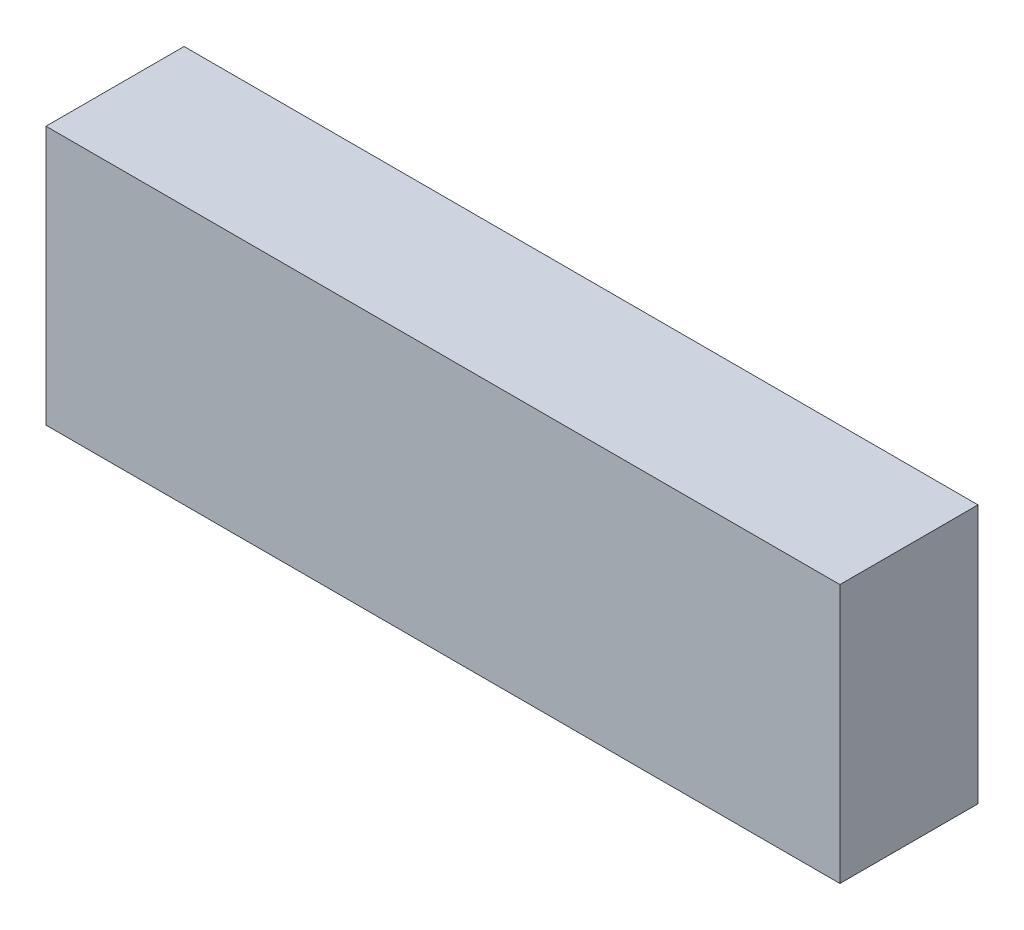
ISO-10303-21;
HEADER;
FILE_DESCRIPTION(('STEP AP214'),'2;1');
FILE_NAME('part.step','',(''),(''),'','','');
FILE_SCHEMA(('AUTOMOTIVE_DESIGN { 1 0 10303 214 1 1 1 1 }'));
ENDSEC;
DATA;
#1=APPLICATION_CONTEXT('core data for automotive mechanical design processes');
#2=APPLICATION_PROTOCOL_DEFINITION('international standard','automotive_design',2000,#1);
#3=PRODUCT_CONTEXT('',#1,'mechanical');
#4=PRODUCT('Part','Part','',(#3));
#5=PRODUCT_RELATED_PRODUCT_CATEGORY('part','',(#4));
#6=PRODUCT_DEFINITION_FORMATION('','',#4);
#7=PRODUCT_DEFINITION_CONTEXT('part definition',#1,'design');
#8=PRODUCT_DEFINITION('design','',#6,#7);
#9=PRODUCT_DEFINITION_SHAPE('','',#8);
#10=(LENGTH_UNIT() NAMED_UNIT(*) SI_UNIT(.MILLI.,.METRE.));
#11=(NAMED_UNIT(*) PLANE_ANGLE_UNIT() SI_UNIT($,.RADIAN.));
#12=(NAMED_UNIT(*) SI_UNIT($,.STERADIAN.) SOLID_ANGLE_UNIT());
#13=UNCERTAINTY_MEASURE_WITH_UNIT(LENGTH_MEASURE(1.E-05),#10,'distance_accuracy_value','');
#14=(GEOMETRIC_REPRESENTATION_CONTEXT(3) GLOBAL_UNCERTAINTY_ASSIGNED_CONTEXT((#13)) GLOBAL_UNIT_ASSIGNED_CONTEXT((#10,
#11,#12)) REPRESENTATION_CONTEXT('',''));
#15=CARTESIAN_POINT('',(0.,0.,0.));
#16=DIRECTION('',(0.,0.,1.));
#17=DIRECTION('',(1.,0.,0.));
#18=AXIS2_PLACEMENT_3D('',#15,#16,#17);
#19=CARTESIAN_POINT('',(115.,37.5,-20.));
#20=DIRECTION('',(-1.,0.,0.));
#21=DIRECTION('',(0.,0.,1.));
#22=AXIS2_PLACEMENT_3D('',#19,#20,#21);
#23=PLANE('',#22);
#24=DIRECTION('',(0.,0.,-1.));
#25=VECTOR('',#24,1.);
#26=CARTESIAN_POINT('',(115.,-37.5,-20.));
#27=LINE('',#26,#25);
#28=CARTESIAN_POINT('',(115.,-37.5,20.));
#29=VERTEX_POINT('',#28);
#30=CARTESIAN_POINT('',(115.,-37.5,-20.));
#31=VERTEX_POINT('',#30);
#32=EDGE_CURVE('E107',#29,#31,#27,.T.);
#33=ORIENTED_EDGE('',*,*,#32,.T.);
#34=DIRECTION('',(0.,-1.,0.));
#35=VECTOR('',#34,1.);
#36=CARTESIAN_POINT('',(115.,37.5,-20.));
#37=LINE('',#36,#35);
#38=CARTESIAN_POINT('',(115.,37.5,-20.));
#39=VERTEX_POINT('',#38);
#40=EDGE_CURVE('E11',#39,#31,#37,.T.);
#41=ORIENTED_EDGE('',*,*,#40,.F.);
#42=DIRECTION('',(0.,0.,-1.));
#43=VECTOR('',#42,1.);
#44=CARTESIAN_POINT('',(115.,37.5,-20.));
#45=LINE('',#44,#43);
#46=CARTESIAN_POINT('',(115.,37.5,20.));
#47=VERTEX_POINT('',#46);
#48=EDGE_CURVE('E91',#47,#39,#45,.T.);
#49=ORIENTED_EDGE('',*,*,#48,.F.);
#50=DIRECTION('',(0.,-1.,0.));
#51=VECTOR('',#50,1.);
#52=CARTESIAN_POINT('',(115.,37.5,20.));
#53=LINE('',#52,#51);
#54=EDGE_CURVE('E103',#47,#29,#53,.T.);
#55=ORIENTED_EDGE('',*,*,#54,.T.);
#56=EDGE_LOOP('',(#33,#41,#49,#55));
#57=FACE_BOUND('',#56,.T.);
#58=ADVANCED_FACE('F39',(#57),#23,.F.);
#59=CARTESIAN_POINT('',(-115.,37.5,-20.));
#60=DIRECTION('',(0.,0.,1.));
#61=DIRECTION('',(1.,0.,0.));
#62=AXIS2_PLACEMENT_3D('',#59,#60,#61);
#63=PLANE('',#62);
#64=DIRECTION('',(-1.,0.,0.));
#65=VECTOR('',#64,1.);
#66=CARTESIAN_POINT('',(-115.,-37.5,-20.));
#67=LINE('',#66,#65);
#68=CARTESIAN_POINT('',(-115.,-37.5,-20.));
#69=VERTEX_POINT('',#68);
#70=EDGE_CURVE('E96',#31,#69,#67,.T.);
#71=ORIENTED_EDGE('',*,*,#70,.T.);
#72=DIRECTION('',(0.,-1.,0.));
#73=VECTOR('',#72,1.);
#74=CARTESIAN_POINT('',(-115.,37.5,-20.));
#75=LINE('',#74,#73);
#76=CARTESIAN_POINT('',(-115.,37.5,-20.));
#77=VERTEX_POINT('',#76);
#78=EDGE_CURVE('E48',#77,#69,#75,.T.);
#79=ORIENTED_EDGE('',*,*,#78,.F.);
#80=DIRECTION('',(-1.,0.,0.));
#81=VECTOR('',#80,1.);
#82=CARTESIAN_POINT('',(-115.,37.5,-20.));
#83=LINE('',#82,#81);
#84=EDGE_CURVE('E86',#39,#77,#83,.T.);
#85=ORIENTED_EDGE('',*,*,#84,.F.);
#86=ORIENTED_EDGE('',*,*,#40,.T.);
#87=EDGE_LOOP('',(#71,#79,#85,#86));
#88=FACE_BOUND('',#87,.T.);
#89=ADVANCED_FACE('F95',(#88),#63,.F.);
#90=CARTESIAN_POINT('',(-115.,37.5,-20.));
#91=DIRECTION('',(1.,0.,0.));
#92=DIRECTION('',(0.,0.,-1.));
#93=AXIS2_PLACEMENT_3D('',#90,#91,#92);
#94=PLANE('',#93);
#95=DIRECTION('',(0.,0.,1.));
#96=VECTOR('',#95,1.);
#97=CARTESIAN_POINT('',(-115.,-37.5,-20.));
#98=LINE('',#97,#96);
#99=CARTESIAN_POINT('',(-115.,-37.5,20.));
#100=VERTEX_POINT('',#99);
#101=EDGE_CURVE('E73',#69,#100,#98,.T.);
#102=ORIENTED_EDGE('',*,*,#101,.T.);
#103=DIRECTION('',(0.,-1.,0.));
#104=VECTOR('',#103,1.);
#105=CARTESIAN_POINT('',(-115.,37.5,20.));
#106=LINE('',#105,#104);
#107=CARTESIAN_POINT('',(-115.,37.5,20.));
#108=VERTEX_POINT('',#107);
#109=EDGE_CURVE('E98',#108,#100,#106,.T.);
#110=ORIENTED_EDGE('',*,*,#109,.F.);
#111=DIRECTION('',(0.,0.,1.));
#112=VECTOR('',#111,1.);
#113=CARTESIAN_POINT('',(-115.,37.5,-20.));
#114=LINE('',#113,#112);
#115=EDGE_CURVE('E89',#77,#108,#114,.T.);
#116=ORIENTED_EDGE('',*,*,#115,.F.);
#117=ORIENTED_EDGE('',*,*,#78,.T.);
#118=EDGE_LOOP('',(#102,#110,#116,#117));
#119=FACE_BOUND('',#118,.T.);
#120=ADVANCED_FACE('F99',(#119),#94,.F.);
#121=CARTESIAN_POINT('',(-115.,37.5,20.));
#122=DIRECTION('',(0.,0.,-1.));
#123=DIRECTION('',(-1.,0.,0.));
#124=AXIS2_PLACEMENT_3D('',#121,#122,#123);
#125=PLANE('',#124);
#126=DIRECTION('',(1.,0.,0.));
#127=VECTOR('',#126,1.);
#128=CARTESIAN_POINT('',(-115.,-37.5,20.));
#129=LINE('',#128,#127);
#130=EDGE_CURVE('E79',#100,#29,#129,.T.);
#131=ORIENTED_EDGE('',*,*,#130,.T.);
#132=ORIENTED_EDGE('',*,*,#54,.F.);
#133=DIRECTION('',(1.,0.,0.));
#134=VECTOR('',#133,1.);
#135=CARTESIAN_POINT('',(-115.,37.5,20.));
#136=LINE('',#135,#134);
#137=EDGE_CURVE('E56',#108,#47,#136,.T.);
#138=ORIENTED_EDGE('',*,*,#137,.F.);
#139=ORIENTED_EDGE('',*,*,#109,.T.);
#140=EDGE_LOOP('',(#131,#132,#138,#139));
#141=FACE_BOUND('',#140,.T.);
#142=ADVANCED_FACE('F120',(#141),#125,.F.);
#143=CARTESIAN_POINT('',(0.,37.5,0.));
#144=DIRECTION('',(0.,1.,0.));
#145=DIRECTION('',(0.,0.,1.));
#146=AXIS2_PLACEMENT_3D('',#143,#144,#145);
#147=PLANE('',#146);
#148=ORIENTED_EDGE('',*,*,#48,.T.);
#149=ORIENTED_EDGE('',*,*,#84,.T.);
#150=ORIENTED_EDGE('',*,*,#115,.T.);
#151=ORIENTED_EDGE('',*,*,#137,.T.);
#152=EDGE_LOOP('',(#148,#149,#150,#151));
#153=FACE_BOUND('',#152,.T.);
#154=ADVANCED_FACE('F87',(#153),#147,.T.);
#155=CARTESIAN_POINT('',(0.,-37.5,0.));
#156=DIRECTION('',(0.,1.,0.));
#157=DIRECTION('',(0.,0.,1.));
#158=AXIS2_PLACEMENT_3D('',#155,#156,#157);
#159=PLANE('',#158);
#160=ORIENTED_EDGE('',*,*,#32,.F.);
#161=ORIENTED_EDGE('',*,*,#130,.F.);
#162=ORIENTED_EDGE('',*,*,#101,.F.);
#163=ORIENTED_EDGE('',*,*,#70,.F.);
#164=EDGE_LOOP('',(#160,#161,#162,#163));
#165=FACE_BOUND('',#164,.T.);
#166=ADVANCED_FACE('F123',(#165),#159,.F.);
#167=CLOSED_SHELL('',(#58,#89,#120,#142,#154,#166));
#168=MANIFOLD_SOLID_BREP('B2',#167);
#169=ADVANCED_BREP_SHAPE_REPRESENTATION('',(#18,#168),#14);
#170=SHAPE_DEFINITION_REPRESENTATION(#9,#169);
ENDSEC;
END-ISO-10303-21;
